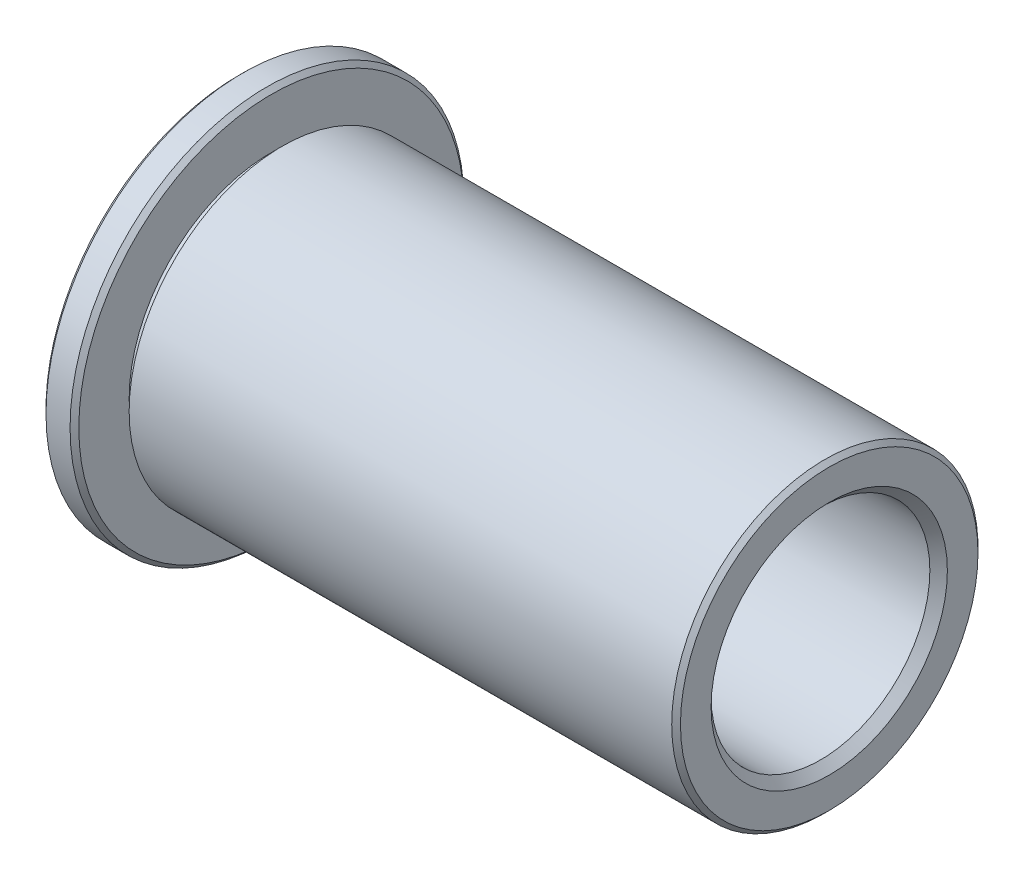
from build123d import *

# Parameters (mm, degrees)
CHANFREIN1_SIZE = 0.4
CHANFREIN2_SIZE = 0.2


with BuildPart() as part:
    # Esquisse1 → R_volution1 (revolve)
    with BuildSketch(Plane.XY, mode=Mode.PRIVATE) as r_volution1_sk:
        Polygon((0, 9), (1.5, 9), (1.5, 6.5), (2, 6.5), (2, 7), (27, 7), (27, 5), (0, 5), align=None)
    revolve(r_volution1_sk.sketch.rotate(Axis((0, 0, 0), (1, 0, 0)), 90), axis=Axis((0, 0, 0), (1, 0, 0)))

    # Chanfrein1
    chanfrein1_edges = [part.edges().sort_by_distance(p)[0] for p in [
        (0, 0, -5),
        (27, 0, -5),
    ]]
    chamfer(chanfrein1_edges, length=CHANFREIN1_SIZE)

    # Chanfrein2
    chanfrein2_edges = [part.edges().sort_by_distance(p)[0] for p in [
        (0, 0, -9),
        (27, 0, -7),
        (1.5, 0, -9),
    ]]
    chamfer(chanfrein2_edges, length=CHANFREIN2_SIZE)


solid = part.part
